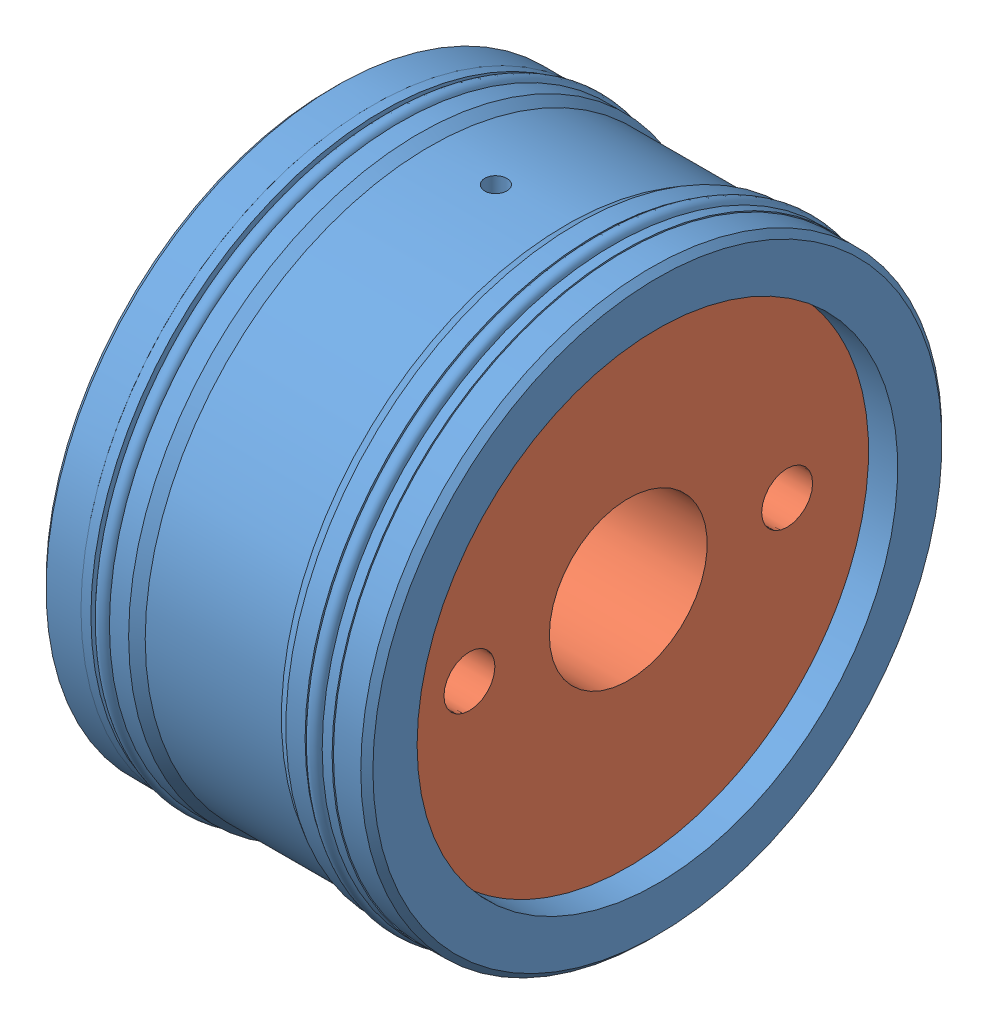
SolidWorks assembly ILC21412100.sldasm, configuration Default (file format 3400). Lengths in mm.
Overall size (54.46 73.84 73.84).
2 component instances, 2 part files, 3 mates.
Components (placement in the parent):
- ILC21412100_BODY-1: ILC21412100_BODY.sldprt [Default] at origin size (41.02 73.84 73.84)
- ILC21412100_PLUNGER-1: ILC21412100_PLUNGER.sldprt [Default] at (16.8529 0 0) x (-1 0 0) z (0 0 1) size (50.8 60.32 60.32)
Mates (geometry in assembly coordinates):
- MID STROKE: distance = 3.6576 mm aligned: plane of ILC21412100_PLUNGER-1 through (16.8529 -9.906 0) normal (1 0 0); plane of ILC21412100_BODY-1 through (20.5105 36.4744 0) normal (1 0 0)
- Coincident2: coincident aligned: unknown of ILC21412100_PLUNGER-1
- Concentric2: concentric anti-aligned: cylinder of ILC21412100_BODY-1; cylinder of ILC21412100_PLUNGER-1
